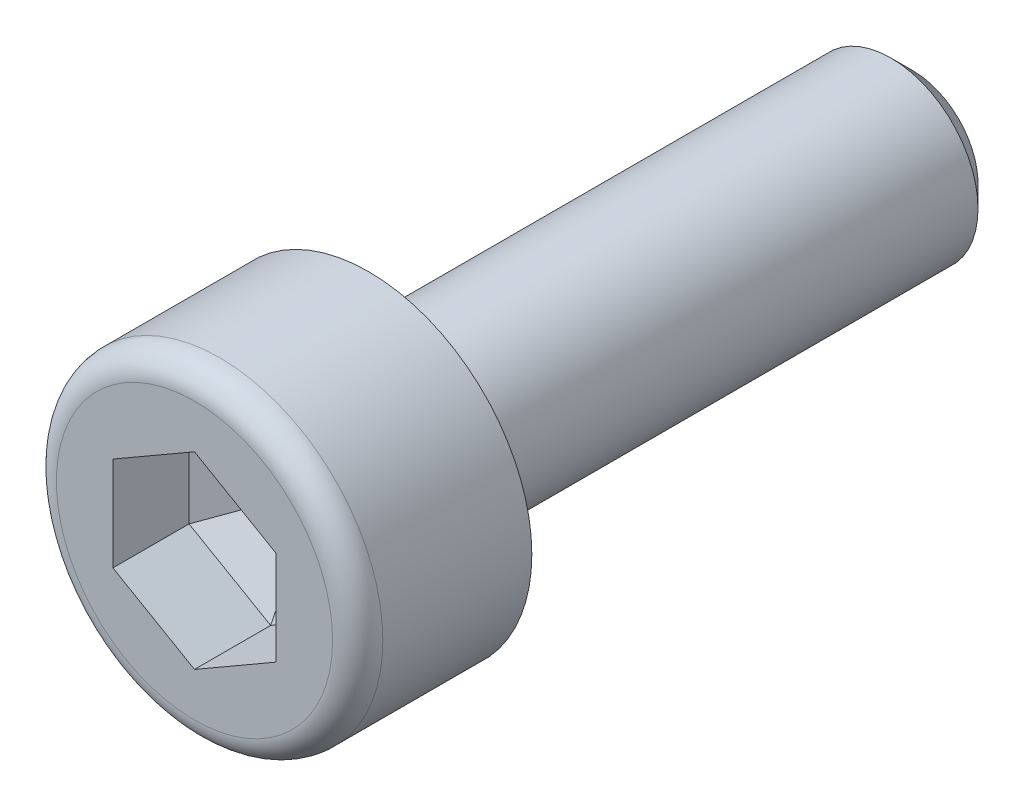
ISO-10303-21;
HEADER;
FILE_DESCRIPTION(('STEP AP214'),'2;1');
FILE_NAME('part.step','',(''),(''),'','','');
FILE_SCHEMA(('AUTOMOTIVE_DESIGN { 1 0 10303 214 1 1 1 1 }'));
ENDSEC;
DATA;
#1=APPLICATION_CONTEXT('core data for automotive mechanical design processes');
#2=APPLICATION_PROTOCOL_DEFINITION('international standard','automotive_design',2000,#1);
#3=PRODUCT_CONTEXT('',#1,'mechanical');
#4=PRODUCT('Part','Part','',(#3));
#5=PRODUCT_RELATED_PRODUCT_CATEGORY('part','',(#4));
#6=PRODUCT_DEFINITION_FORMATION('','',#4);
#7=PRODUCT_DEFINITION_CONTEXT('part definition',#1,'design');
#8=PRODUCT_DEFINITION('design','',#6,#7);
#9=PRODUCT_DEFINITION_SHAPE('','',#8);
#10=(LENGTH_UNIT() NAMED_UNIT(*) SI_UNIT(.MILLI.,.METRE.));
#11=(NAMED_UNIT(*) PLANE_ANGLE_UNIT() SI_UNIT($,.RADIAN.));
#12=(NAMED_UNIT(*) SI_UNIT($,.STERADIAN.) SOLID_ANGLE_UNIT());
#13=UNCERTAINTY_MEASURE_WITH_UNIT(LENGTH_MEASURE(1.E-05),#10,'distance_accuracy_value','');
#14=(GEOMETRIC_REPRESENTATION_CONTEXT(3) GLOBAL_UNCERTAINTY_ASSIGNED_CONTEXT((#13)) GLOBAL_UNIT_ASSIGNED_CONTEXT((#10,
#11,#12)) REPRESENTATION_CONTEXT('',''));
#15=CARTESIAN_POINT('',(0.,0.,0.));
#16=DIRECTION('',(0.,0.,1.));
#17=DIRECTION('',(1.,0.,0.));
#18=AXIS2_PLACEMENT_3D('',#15,#16,#17);
#19=CARTESIAN_POINT('',(0.,0.,0.));
#20=DIRECTION('',(0.,0.,1.));
#21=DIRECTION('',(1.,0.,0.));
#22=AXIS2_PLACEMENT_3D('',#19,#20,#21);
#23=PLANE('',#22);
#24=CARTESIAN_POINT('',(0.,0.,0.));
#25=DIRECTION('',(0.,0.,1.));
#26=DIRECTION('',(1.,0.,0.));
#27=AXIS2_PLACEMENT_3D('',#24,#25,#26);
#28=CIRCLE('',#27,0.9);
#29=CARTESIAN_POINT('',(0.9,0.,0.));
#30=VERTEX_POINT('',#29);
#31=EDGE_CURVE('E11',#30,#30,#28,.T.);
#32=ORIENTED_EDGE('',*,*,#31,.T.);
#33=EDGE_LOOP('',(#32));
#34=FACE_BOUND('',#33,.T.);
#35=CARTESIAN_POINT('',(0.,0.,0.));
#36=DIRECTION('',(0.,0.,1.));
#37=DIRECTION('',(1.,0.,0.));
#38=AXIS2_PLACEMENT_3D('',#35,#36,#37);
#39=CIRCLE('',#38,1.5);
#40=CARTESIAN_POINT('',(1.5,0.,0.));
#41=VERTEX_POINT('',#40);
#42=EDGE_CURVE('E155',#41,#41,#39,.T.);
#43=ORIENTED_EDGE('',*,*,#42,.F.);
#44=EDGE_LOOP('',(#43));
#45=FACE_BOUND('',#44,.T.);
#46=ADVANCED_FACE('F45',(#34,#45),#23,.F.);
#47=CARTESIAN_POINT('',(0.,0.,1.6));
#48=DIRECTION('',(0.,0.,-1.));
#49=DIRECTION('',(-1.,0.,0.));
#50=AXIS2_PLACEMENT_3D('',#47,#48,#49);
#51=CYLINDRICAL_SURFACE('',#50,1.5);
#52=CARTESIAN_POINT('',(0.,0.,1.36923076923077));
#53=DIRECTION('',(0.,0.,1.));
#54=DIRECTION('',(1.,0.,0.));
#55=AXIS2_PLACEMENT_3D('',#52,#53,#54);
#56=CIRCLE('',#55,1.5);
#57=CARTESIAN_POINT('',(1.5,0.,1.36923076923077));
#58=VERTEX_POINT('',#57);
#59=EDGE_CURVE('E173',#58,#58,#56,.F.);
#60=ORIENTED_EDGE('',*,*,#59,.T.);
#61=EDGE_LOOP('',(#60));
#62=FACE_BOUND('',#61,.T.);
#63=ORIENTED_EDGE('',*,*,#42,.T.);
#64=EDGE_LOOP('',(#63));
#65=FACE_BOUND('',#64,.T.);
#66=ADVANCED_FACE('F232',(#62,#65),#51,.T.);
#67=CARTESIAN_POINT('',(0.,0.,1.6));
#68=DIRECTION('',(0.,0.,1.));
#69=DIRECTION('',(1.,0.,0.));
#70=AXIS2_PLACEMENT_3D('',#67,#68,#69);
#71=PLANE('',#70);
#72=CARTESIAN_POINT('',(0.,0.,1.6));
#73=DIRECTION('',(0.,0.,1.));
#74=DIRECTION('',(1.,0.,0.));
#75=AXIS2_PLACEMENT_3D('',#72,#73,#74);
#76=CIRCLE('',#75,1.26923076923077);
#77=CARTESIAN_POINT('',(1.26923076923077,0.,1.6));
#78=VERTEX_POINT('',#77);
#79=EDGE_CURVE('E170',#78,#78,#76,.T.);
#80=ORIENTED_EDGE('',*,*,#79,.T.);
#81=EDGE_LOOP('',(#80));
#82=FACE_BOUND('',#81,.T.);
#83=DIRECTION('',(0.,1.,0.));
#84=VECTOR('',#83,1.);
#85=CARTESIAN_POINT('',(0.75,-0.43301270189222,1.6));
#86=LINE('',#85,#84);
#87=CARTESIAN_POINT('',(0.75,-0.43301270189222,1.6));
#88=VERTEX_POINT('',#87);
#89=CARTESIAN_POINT('',(0.75,0.433012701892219,1.6));
#90=VERTEX_POINT('',#89);
#91=EDGE_CURVE('E137',#88,#90,#86,.T.);
#92=ORIENTED_EDGE('',*,*,#91,.F.);
#93=DIRECTION('',(0.866025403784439,0.5,0.));
#94=VECTOR('',#93,1.);
#95=CARTESIAN_POINT('',(0.,-0.866025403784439,1.6));
#96=LINE('',#95,#94);
#97=CARTESIAN_POINT('',(0.,-0.866025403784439,1.6));
#98=VERTEX_POINT('',#97);
#99=EDGE_CURVE('E150',#98,#88,#96,.T.);
#100=ORIENTED_EDGE('',*,*,#99,.F.);
#101=DIRECTION('',(0.866025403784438,-0.5,0.));
#102=VECTOR('',#101,1.);
#103=CARTESIAN_POINT('',(-0.75,-0.433012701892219,1.6));
#104=LINE('',#103,#102);
#105=CARTESIAN_POINT('',(-0.75,-0.433012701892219,1.6));
#106=VERTEX_POINT('',#105);
#107=EDGE_CURVE('E144',#106,#98,#104,.T.);
#108=ORIENTED_EDGE('',*,*,#107,.F.);
#109=DIRECTION('',(0.,-1.,0.));
#110=VECTOR('',#109,1.);
#111=CARTESIAN_POINT('',(-0.75,0.433012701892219,1.6));
#112=LINE('',#111,#110);
#113=CARTESIAN_POINT('',(-0.75,0.433012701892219,1.6));
#114=VERTEX_POINT('',#113);
#115=EDGE_CURVE('E142',#114,#106,#112,.T.);
#116=ORIENTED_EDGE('',*,*,#115,.F.);
#117=DIRECTION('',(-0.866025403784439,-0.5,0.));
#118=VECTOR('',#117,1.);
#119=CARTESIAN_POINT('',(0.,0.866025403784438,1.6));
#120=LINE('',#119,#118);
#121=CARTESIAN_POINT('',(0.,0.866025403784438,1.6));
#122=VERTEX_POINT('',#121);
#123=EDGE_CURVE('E122',#122,#114,#120,.T.);
#124=ORIENTED_EDGE('',*,*,#123,.F.);
#125=DIRECTION('',(-0.866025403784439,0.5,0.));
#126=VECTOR('',#125,1.);
#127=CARTESIAN_POINT('',(0.75,0.433012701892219,1.6));
#128=LINE('',#127,#126);
#129=EDGE_CURVE('E132',#90,#122,#128,.T.);
#130=ORIENTED_EDGE('',*,*,#129,.F.);
#131=EDGE_LOOP('',(#92,#100,#108,#116,#124,#130));
#132=FACE_BOUND('',#131,.T.);
#133=ADVANCED_FACE('F139',(#82,#132),#71,.T.);
#134=CARTESIAN_POINT('',(0.75,-0.43301270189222,0.467723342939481));
#135=DIRECTION('',(1.,0.,0.));
#136=DIRECTION('',(0.,1.,0.));
#137=AXIS2_PLACEMENT_3D('',#134,#135,#136);
#138=PLANE('',#137);
#139=DIRECTION('',(0.,0.,1.));
#140=VECTOR('',#139,1.);
#141=CARTESIAN_POINT('',(0.75,0.433012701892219,0.467723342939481));
#142=LINE('',#141,#140);
#143=CARTESIAN_POINT('',(0.75,0.433012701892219,0.899999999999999));
#144=VERTEX_POINT('',#143);
#145=EDGE_CURVE('E129',#144,#90,#142,.T.);
#146=ORIENTED_EDGE('',*,*,#145,.F.);
#147=DIRECTION('',(0.,-1.,0.));
#148=VECTOR('',#147,1.);
#149=CARTESIAN_POINT('',(0.75,-0.43301270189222,0.899999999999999));
#150=LINE('',#149,#148);
#151=CARTESIAN_POINT('',(0.75,-0.43301270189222,0.899999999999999));
#152=VERTEX_POINT('',#151);
#153=EDGE_CURVE('E68',#144,#152,#150,.T.);
#154=ORIENTED_EDGE('',*,*,#153,.T.);
#155=DIRECTION('',(0.,0.,1.));
#156=VECTOR('',#155,1.);
#157=CARTESIAN_POINT('',(0.75,-0.43301270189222,0.467723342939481));
#158=LINE('',#157,#156);
#159=EDGE_CURVE('E153',#152,#88,#158,.T.);
#160=ORIENTED_EDGE('',*,*,#159,.T.);
#161=ORIENTED_EDGE('',*,*,#91,.T.);
#162=EDGE_LOOP('',(#146,#154,#160,#161));
#163=FACE_BOUND('',#162,.T.);
#164=ADVANCED_FACE('F292',(#163),#138,.F.);
#165=CARTESIAN_POINT('',(0.,-0.866025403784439,0.467723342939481));
#166=DIRECTION('',(0.5,-0.866025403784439,0.));
#167=DIRECTION('',(0.866025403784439,0.5,0.));
#168=AXIS2_PLACEMENT_3D('',#165,#166,#167);
#169=PLANE('',#168);
#170=ORIENTED_EDGE('',*,*,#159,.F.);
#171=DIRECTION('',(-0.866025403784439,-0.5,0.));
#172=VECTOR('',#171,1.);
#173=CARTESIAN_POINT('',(0.,-0.866025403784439,0.899999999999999));
#174=LINE('',#173,#172);
#175=CARTESIAN_POINT('',(0.,-0.866025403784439,0.899999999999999));
#176=VERTEX_POINT('',#175);
#177=EDGE_CURVE('E60',#152,#176,#174,.T.);
#178=ORIENTED_EDGE('',*,*,#177,.T.);
#179=DIRECTION('',(0.,0.,1.));
#180=VECTOR('',#179,1.);
#181=CARTESIAN_POINT('',(0.,-0.866025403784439,0.467723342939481));
#182=LINE('',#181,#180);
#183=EDGE_CURVE('E156',#176,#98,#182,.T.);
#184=ORIENTED_EDGE('',*,*,#183,.T.);
#185=ORIENTED_EDGE('',*,*,#99,.T.);
#186=EDGE_LOOP('',(#170,#178,#184,#185));
#187=FACE_BOUND('',#186,.T.);
#188=ADVANCED_FACE('F294',(#187),#169,.F.);
#189=CARTESIAN_POINT('',(-0.75,-0.433012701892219,0.467723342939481));
#190=DIRECTION('',(-0.5,-0.866025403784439,0.));
#191=DIRECTION('',(0.866025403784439,-0.5,0.));
#192=AXIS2_PLACEMENT_3D('',#189,#190,#191);
#193=PLANE('',#192);
#194=ORIENTED_EDGE('',*,*,#183,.F.);
#195=DIRECTION('',(-0.866025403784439,0.5,0.));
#196=VECTOR('',#195,1.);
#197=CARTESIAN_POINT('',(-0.75,-0.433012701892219,0.899999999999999));
#198=LINE('',#197,#196);
#199=CARTESIAN_POINT('',(-0.75,-0.433012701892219,0.899999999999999));
#200=VERTEX_POINT('',#199);
#201=EDGE_CURVE('E196',#176,#200,#198,.T.);
#202=ORIENTED_EDGE('',*,*,#201,.T.);
#203=DIRECTION('',(0.,0.,1.));
#204=VECTOR('',#203,1.);
#205=CARTESIAN_POINT('',(-0.75,-0.433012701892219,0.467723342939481));
#206=LINE('',#205,#204);
#207=EDGE_CURVE('E158',#200,#106,#206,.T.);
#208=ORIENTED_EDGE('',*,*,#207,.T.);
#209=ORIENTED_EDGE('',*,*,#107,.T.);
#210=EDGE_LOOP('',(#194,#202,#208,#209));
#211=FACE_BOUND('',#210,.T.);
#212=ADVANCED_FACE('F283',(#211),#193,.F.);
#213=CARTESIAN_POINT('',(-0.75,0.433012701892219,0.467723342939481));
#214=DIRECTION('',(-1.,0.,0.));
#215=DIRECTION('',(0.,0.,1.));
#216=AXIS2_PLACEMENT_3D('',#213,#214,#215);
#217=PLANE('',#216);
#218=ORIENTED_EDGE('',*,*,#207,.F.);
#219=DIRECTION('',(0.,1.,0.));
#220=VECTOR('',#219,1.);
#221=CARTESIAN_POINT('',(-0.75,0.433012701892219,0.899999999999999));
#222=LINE('',#221,#220);
#223=CARTESIAN_POINT('',(-0.75,0.433012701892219,0.899999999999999));
#224=VERTEX_POINT('',#223);
#225=EDGE_CURVE('E189',#200,#224,#222,.T.);
#226=ORIENTED_EDGE('',*,*,#225,.T.);
#227=DIRECTION('',(0.,0.,1.));
#228=VECTOR('',#227,1.);
#229=CARTESIAN_POINT('',(-0.75,0.433012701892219,0.467723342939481));
#230=LINE('',#229,#228);
#231=EDGE_CURVE('E128',#224,#114,#230,.T.);
#232=ORIENTED_EDGE('',*,*,#231,.T.);
#233=ORIENTED_EDGE('',*,*,#115,.T.);
#234=EDGE_LOOP('',(#218,#226,#232,#233));
#235=FACE_BOUND('',#234,.T.);
#236=ADVANCED_FACE('F286',(#235),#217,.F.);
#237=CARTESIAN_POINT('',(0.,0.866025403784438,0.467723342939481));
#238=DIRECTION('',(-0.5,0.866025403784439,0.));
#239=DIRECTION('',(-0.866025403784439,-0.5,0.));
#240=AXIS2_PLACEMENT_3D('',#237,#238,#239);
#241=PLANE('',#240);
#242=ORIENTED_EDGE('',*,*,#231,.F.);
#243=DIRECTION('',(0.866025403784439,0.5,0.));
#244=VECTOR('',#243,1.);
#245=CARTESIAN_POINT('',(0.,0.866025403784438,0.899999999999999));
#246=LINE('',#245,#244);
#247=CARTESIAN_POINT('',(0.,0.866025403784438,0.899999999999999));
#248=VERTEX_POINT('',#247);
#249=EDGE_CURVE('E125',#224,#248,#246,.T.);
#250=ORIENTED_EDGE('',*,*,#249,.T.);
#251=DIRECTION('',(0.,0.,1.));
#252=VECTOR('',#251,1.);
#253=CARTESIAN_POINT('',(0.,0.866025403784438,0.467723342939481));
#254=LINE('',#253,#252);
#255=EDGE_CURVE('E117',#248,#122,#254,.T.);
#256=ORIENTED_EDGE('',*,*,#255,.T.);
#257=ORIENTED_EDGE('',*,*,#123,.T.);
#258=EDGE_LOOP('',(#242,#250,#256,#257));
#259=FACE_BOUND('',#258,.T.);
#260=ADVANCED_FACE('F120',(#259),#241,.F.);
#261=CARTESIAN_POINT('',(0.75,0.433012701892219,0.467723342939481));
#262=DIRECTION('',(0.5,0.866025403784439,0.));
#263=DIRECTION('',(-0.866025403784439,0.5,0.));
#264=AXIS2_PLACEMENT_3D('',#261,#262,#263);
#265=PLANE('',#264);
#266=ORIENTED_EDGE('',*,*,#255,.F.);
#267=DIRECTION('',(0.866025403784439,-0.5,0.));
#268=VECTOR('',#267,1.);
#269=CARTESIAN_POINT('',(0.75,0.433012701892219,0.899999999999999));
#270=LINE('',#269,#268);
#271=EDGE_CURVE('E193',#248,#144,#270,.T.);
#272=ORIENTED_EDGE('',*,*,#271,.T.);
#273=ORIENTED_EDGE('',*,*,#145,.T.);
#274=ORIENTED_EDGE('',*,*,#129,.T.);
#275=EDGE_LOOP('',(#266,#272,#273,#274));
#276=FACE_BOUND('',#275,.T.);
#277=ADVANCED_FACE('F133',(#276),#265,.F.);
#278=CARTESIAN_POINT('',(0.,0.,0.467723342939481));
#279=DIRECTION('',(0.,0.,1.));
#280=DIRECTION('',(1.,0.,0.));
#281=AXIS2_PLACEMENT_3D('',#278,#279,#280);
#282=PLANE('',#281);
#283=DIRECTION('',(-0.866025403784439,-0.5,0.));
#284=VECTOR('',#283,1.);
#285=CARTESIAN_POINT('',(-0.000637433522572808,0.00110406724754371,0.467723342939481));
#286=LINE('',#285,#284);
#287=CARTESIAN_POINT('',(0.,0.00147208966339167,0.467723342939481));
#288=VERTEX_POINT('',#287);
#289=CARTESIAN_POINT('',(-0.00127486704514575,0.000736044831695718,0.467723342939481));
#290=VERTEX_POINT('',#289);
#291=EDGE_CURVE('E184',#288,#290,#286,.T.);
#292=ORIENTED_EDGE('',*,*,#291,.T.);
#293=DIRECTION('',(0.,-1.,0.));
#294=VECTOR('',#293,1.);
#295=CARTESIAN_POINT('',(-0.00127486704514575,0.,0.467723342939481));
#296=LINE('',#295,#294);
#297=CARTESIAN_POINT('',(-0.00127486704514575,-0.000736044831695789,0.467723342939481));
#298=VERTEX_POINT('',#297);
#299=EDGE_CURVE('E186',#290,#298,#296,.T.);
#300=ORIENTED_EDGE('',*,*,#299,.T.);
#301=DIRECTION('',(0.866025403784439,-0.5,0.));
#302=VECTOR('',#301,1.);
#303=CARTESIAN_POINT('',(-0.000637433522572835,-0.00110406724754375,0.467723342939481));
#304=LINE('',#303,#302);
#305=CARTESIAN_POINT('',(0.,-0.00147208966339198,0.467723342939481));
#306=VERTEX_POINT('',#305);
#307=EDGE_CURVE('E178',#298,#306,#304,.T.);
#308=ORIENTED_EDGE('',*,*,#307,.T.);
#309=DIRECTION('',(0.866025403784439,0.5,0.));
#310=VECTOR('',#309,1.);
#311=CARTESIAN_POINT('',(0.000637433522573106,-0.00110406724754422,0.467723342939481));
#312=LINE('',#311,#310);
#313=CARTESIAN_POINT('',(0.00127486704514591,-0.000736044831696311,0.467723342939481));
#314=VERTEX_POINT('',#313);
#315=EDGE_CURVE('E176',#306,#314,#312,.T.);
#316=ORIENTED_EDGE('',*,*,#315,.T.);
#317=DIRECTION('',(0.,1.,0.));
#318=VECTOR('',#317,1.);
#319=CARTESIAN_POINT('',(0.00127486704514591,0.,0.467723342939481));
#320=LINE('',#319,#318);
#321=CARTESIAN_POINT('',(0.00127486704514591,0.000736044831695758,0.467723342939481));
#322=VERTEX_POINT('',#321);
#323=EDGE_CURVE('E180',#314,#322,#320,.T.);
#324=ORIENTED_EDGE('',*,*,#323,.T.);
#325=DIRECTION('',(-0.866025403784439,0.5,0.));
#326=VECTOR('',#325,1.);
#327=CARTESIAN_POINT('',(0.000637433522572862,0.0011040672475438,0.467723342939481));
#328=LINE('',#327,#326);
#329=EDGE_CURVE('E182',#322,#288,#328,.T.);
#330=ORIENTED_EDGE('',*,*,#329,.T.);
#331=EDGE_LOOP('',(#292,#300,#308,#316,#324,#330));
#332=FACE_BOUND('',#331,.T.);
#333=ADVANCED_FACE('F303',(#332),#282,.T.);
#334=CARTESIAN_POINT('',(0.,0.,-5.));
#335=DIRECTION('',(0.,0.,1.));
#336=DIRECTION('',(1.,0.,0.));
#337=AXIS2_PLACEMENT_3D('',#334,#335,#336);
#338=CYLINDRICAL_SURFACE('',#337,0.8);
#339=CARTESIAN_POINT('',(0.,0.,-0.1));
#340=DIRECTION('',(0.,0.,1.));
#341=DIRECTION('',(1.,0.,0.));
#342=AXIS2_PLACEMENT_3D('',#339,#340,#341);
#343=CIRCLE('',#342,0.8);
#344=CARTESIAN_POINT('',(0.8,0.,-0.1));
#345=VERTEX_POINT('',#344);
#346=EDGE_CURVE('E53',#345,#345,#343,.F.);
#347=ORIENTED_EDGE('',*,*,#346,.T.);
#348=EDGE_LOOP('',(#347));
#349=FACE_BOUND('',#348,.T.);
#350=CARTESIAN_POINT('',(0.,0.,-4.8));
#351=DIRECTION('',(0.,0.,-1.));
#352=DIRECTION('',(-1.,0.,0.));
#353=AXIS2_PLACEMENT_3D('',#350,#351,#352);
#354=CIRCLE('',#353,0.8);
#355=CARTESIAN_POINT('',(-0.8,0.,-4.8));
#356=VERTEX_POINT('',#355);
#357=EDGE_CURVE('E167',#356,#356,#354,.F.);
#358=ORIENTED_EDGE('',*,*,#357,.T.);
#359=EDGE_LOOP('',(#358));
#360=FACE_BOUND('',#359,.T.);
#361=ADVANCED_FACE('F217',(#349,#360),#338,.T.);
#362=CARTESIAN_POINT('',(0.,0.,-5.));
#363=DIRECTION('',(0.,0.,-1.));
#364=DIRECTION('',(-1.,0.,0.));
#365=AXIS2_PLACEMENT_3D('',#362,#363,#364);
#366=PLANE('',#365);
#367=CARTESIAN_POINT('',(0.,0.,-5.));
#368=DIRECTION('',(0.,0.,-1.));
#369=DIRECTION('',(-1.,0.,0.));
#370=AXIS2_PLACEMENT_3D('',#367,#368,#369);
#371=CIRCLE('',#370,0.600000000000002);
#372=CARTESIAN_POINT('',(-0.600000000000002,0.,-5.));
#373=VERTEX_POINT('',#372);
#374=EDGE_CURVE('E164',#373,#373,#371,.T.);
#375=ORIENTED_EDGE('',*,*,#374,.T.);
#376=EDGE_LOOP('',(#375));
#377=FACE_BOUND('',#376,.T.);
#378=ADVANCED_FACE('F248',(#377),#366,.T.);
#379=CARTESIAN_POINT('',(0.,0.,-5.));
#380=DIRECTION('',(0.,0.,1.));
#381=DIRECTION('',(1.,0.,0.));
#382=AXIS2_PLACEMENT_3D('',#379,#380,#381);
#383=CONICAL_SURFACE('',#382,0.600000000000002,0.785398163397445);
#384=ORIENTED_EDGE('',*,*,#357,.F.);
#385=EDGE_LOOP('',(#384));
#386=FACE_BOUND('',#385,.T.);
#387=ORIENTED_EDGE('',*,*,#374,.F.);
#388=EDGE_LOOP('',(#387));
#389=FACE_BOUND('',#388,.T.);
#390=ADVANCED_FACE('F244',(#386,#389),#383,.T.);
#391=CARTESIAN_POINT('',(0.,0.,1.36923076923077));
#392=DIRECTION('',(0.,0.,1.));
#393=DIRECTION('',(1.,0.,0.));
#394=AXIS2_PLACEMENT_3D('',#391,#392,#393);
#395=TOROIDAL_SURFACE('',#394,1.26923076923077,0.230769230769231);
#396=ORIENTED_EDGE('',*,*,#59,.F.);
#397=EDGE_LOOP('',(#396));
#398=FACE_BOUND('',#397,.T.);
#399=ORIENTED_EDGE('',*,*,#79,.F.);
#400=EDGE_LOOP('',(#399));
#401=FACE_BOUND('',#400,.T.);
#402=ADVANCED_FACE('F247',(#398,#401),#395,.T.);
#403=CARTESIAN_POINT('',(0.00127486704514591,0.,0.467723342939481));
#404=DIRECTION('',(0.499999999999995,0.,-0.866025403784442));
#405=DIRECTION('',(0.,1.,0.));
#406=AXIS2_PLACEMENT_3D('',#403,#404,#405);
#407=PLANE('',#406);
#408=DIRECTION('',(-0.774596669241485,0.447213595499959,-0.447213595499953));
#409=VECTOR('',#408,1.);
#410=CARTESIAN_POINT('',(0.00101989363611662,-0.000588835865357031,0.467576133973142));
#411=LINE('',#410,#409);
#412=EDGE_CURVE('E209',#152,#314,#411,.T.);
#413=ORIENTED_EDGE('',*,*,#412,.F.);
#414=ORIENTED_EDGE('',*,*,#153,.F.);
#415=DIRECTION('',(-0.774596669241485,-0.447213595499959,-0.447213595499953));
#416=VECTOR('',#415,1.);
#417=CARTESIAN_POINT('',(0.00101989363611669,0.000588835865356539,0.467576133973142));
#418=LINE('',#417,#416);
#419=EDGE_CURVE('E212',#322,#144,#418,.F.);
#420=ORIENTED_EDGE('',*,*,#419,.F.);
#421=ORIENTED_EDGE('',*,*,#323,.F.);
#422=EDGE_LOOP('',(#413,#414,#420,#421));
#423=FACE_BOUND('',#422,.T.);
#424=ADVANCED_FACE('F251',(#423),#407,.F.);
#425=CARTESIAN_POINT('',(0.000637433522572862,0.0011040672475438,0.467723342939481));
#426=DIRECTION('',(0.249999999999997,0.433012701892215,-0.866025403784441));
#427=DIRECTION('',(-0.866025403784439,0.5,0.));
#428=AXIS2_PLACEMENT_3D('',#425,#426,#427);
#429=PLANE('',#428);
#430=ORIENTED_EDGE('',*,*,#419,.T.);
#431=ORIENTED_EDGE('',*,*,#271,.F.);
#432=DIRECTION('',(0.,-0.894427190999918,-0.447213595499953));
#433=VECTOR('',#432,1.);
#434=CARTESIAN_POINT('',(0.,0.00117767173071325,0.467576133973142));
#435=LINE('',#434,#433);
#436=EDGE_CURVE('E206',#288,#248,#435,.F.);
#437=ORIENTED_EDGE('',*,*,#436,.F.);
#438=ORIENTED_EDGE('',*,*,#329,.F.);
#439=EDGE_LOOP('',(#430,#431,#437,#438));
#440=FACE_BOUND('',#439,.T.);
#441=ADVANCED_FACE('F264',(#440),#429,.F.);
#442=CARTESIAN_POINT('',(0.000637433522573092,-0.0011040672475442,0.467723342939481));
#443=DIRECTION('',(0.249999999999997,-0.433012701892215,-0.866025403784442));
#444=DIRECTION('',(0.866025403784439,0.5,0.));
#445=AXIS2_PLACEMENT_3D('',#442,#443,#444);
#446=PLANE('',#445);
#447=ORIENTED_EDGE('',*,*,#412,.T.);
#448=ORIENTED_EDGE('',*,*,#315,.F.);
#449=DIRECTION('',(0.,-0.894427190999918,0.447213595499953));
#450=VECTOR('',#449,1.);
#451=CARTESIAN_POINT('',(0.,-0.00117767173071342,0.467576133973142));
#452=LINE('',#451,#450);
#453=EDGE_CURVE('E203',#176,#306,#452,.F.);
#454=ORIENTED_EDGE('',*,*,#453,.F.);
#455=ORIENTED_EDGE('',*,*,#177,.F.);
#456=EDGE_LOOP('',(#447,#448,#454,#455));
#457=FACE_BOUND('',#456,.T.);
#458=ADVANCED_FACE('F260',(#457),#446,.F.);
#459=CARTESIAN_POINT('',(-0.000637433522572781,0.00110406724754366,0.467723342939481));
#460=DIRECTION('',(-0.249999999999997,0.433012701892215,-0.866025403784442));
#461=DIRECTION('',(-0.866025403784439,-0.5,0.));
#462=AXIS2_PLACEMENT_3D('',#459,#460,#461);
#463=PLANE('',#462);
#464=ORIENTED_EDGE('',*,*,#436,.T.);
#465=ORIENTED_EDGE('',*,*,#249,.F.);
#466=DIRECTION('',(0.774596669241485,-0.447213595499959,-0.447213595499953));
#467=VECTOR('',#466,1.);
#468=CARTESIAN_POINT('',(-0.00101989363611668,0.00058883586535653,0.467576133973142));
#469=LINE('',#468,#467);
#470=EDGE_CURVE('E201',#290,#224,#469,.F.);
#471=ORIENTED_EDGE('',*,*,#470,.F.);
#472=ORIENTED_EDGE('',*,*,#291,.F.);
#473=EDGE_LOOP('',(#464,#465,#471,#472));
#474=FACE_BOUND('',#473,.T.);
#475=ADVANCED_FACE('F256',(#474),#463,.F.);
#476=CARTESIAN_POINT('',(-0.000637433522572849,-0.00110406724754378,0.467723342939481));
#477=DIRECTION('',(-0.249999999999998,-0.433012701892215,-0.866025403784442));
#478=DIRECTION('',(0.866025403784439,-0.5,0.));
#479=AXIS2_PLACEMENT_3D('',#476,#477,#478);
#480=PLANE('',#479);
#481=ORIENTED_EDGE('',*,*,#453,.T.);
#482=ORIENTED_EDGE('',*,*,#307,.F.);
#483=DIRECTION('',(-0.774596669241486,-0.447213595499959,0.447213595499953));
#484=VECTOR('',#483,1.);
#485=CARTESIAN_POINT('',(-0.00101989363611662,-0.000588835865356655,0.467576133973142));
#486=LINE('',#485,#484);
#487=EDGE_CURVE('E199',#200,#298,#486,.F.);
#488=ORIENTED_EDGE('',*,*,#487,.F.);
#489=ORIENTED_EDGE('',*,*,#201,.F.);
#490=EDGE_LOOP('',(#481,#482,#488,#489));
#491=FACE_BOUND('',#490,.T.);
#492=ADVANCED_FACE('F227',(#491),#480,.F.);
#493=CARTESIAN_POINT('',(-0.00127486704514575,0.,0.467723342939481));
#494=DIRECTION('',(-0.499999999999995,0.,-0.866025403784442));
#495=DIRECTION('',(0.,-1.,0.));
#496=AXIS2_PLACEMENT_3D('',#493,#494,#495);
#497=PLANE('',#496);
#498=ORIENTED_EDGE('',*,*,#470,.T.);
#499=ORIENTED_EDGE('',*,*,#225,.F.);
#500=ORIENTED_EDGE('',*,*,#487,.T.);
#501=ORIENTED_EDGE('',*,*,#299,.F.);
#502=EDGE_LOOP('',(#498,#499,#500,#501));
#503=FACE_BOUND('',#502,.T.);
#504=ADVANCED_FACE('F221',(#503),#497,.F.);
#505=CARTESIAN_POINT('',(0.,0.,-0.1));
#506=DIRECTION('',(0.,0.,1.));
#507=DIRECTION('',(1.,0.,0.));
#508=AXIS2_PLACEMENT_3D('',#505,#506,#507);
#509=TOROIDAL_SURFACE('',#508,0.9,0.1);
#510=ORIENTED_EDGE('',*,*,#31,.F.);
#511=EDGE_LOOP('',(#510));
#512=FACE_BOUND('',#511,.T.);
#513=ORIENTED_EDGE('',*,*,#346,.F.);
#514=EDGE_LOOP('',(#513));
#515=FACE_BOUND('',#514,.T.);
#516=ADVANCED_FACE('F47',(#512,#515),#509,.F.);
#517=CLOSED_SHELL('',(#46,#66,#133,#164,#188,#212,#236,#260,#277,#333,#361,#378,#390,#402,#424,
#441,#458,#475,#492,#504,#516));
#518=MANIFOLD_SOLID_BREP('B2',#517);
#519=ADVANCED_BREP_SHAPE_REPRESENTATION('',(#18,#518),#14);
#520=SHAPE_DEFINITION_REPRESENTATION(#9,#519);
ENDSEC;
END-ISO-10303-21;
